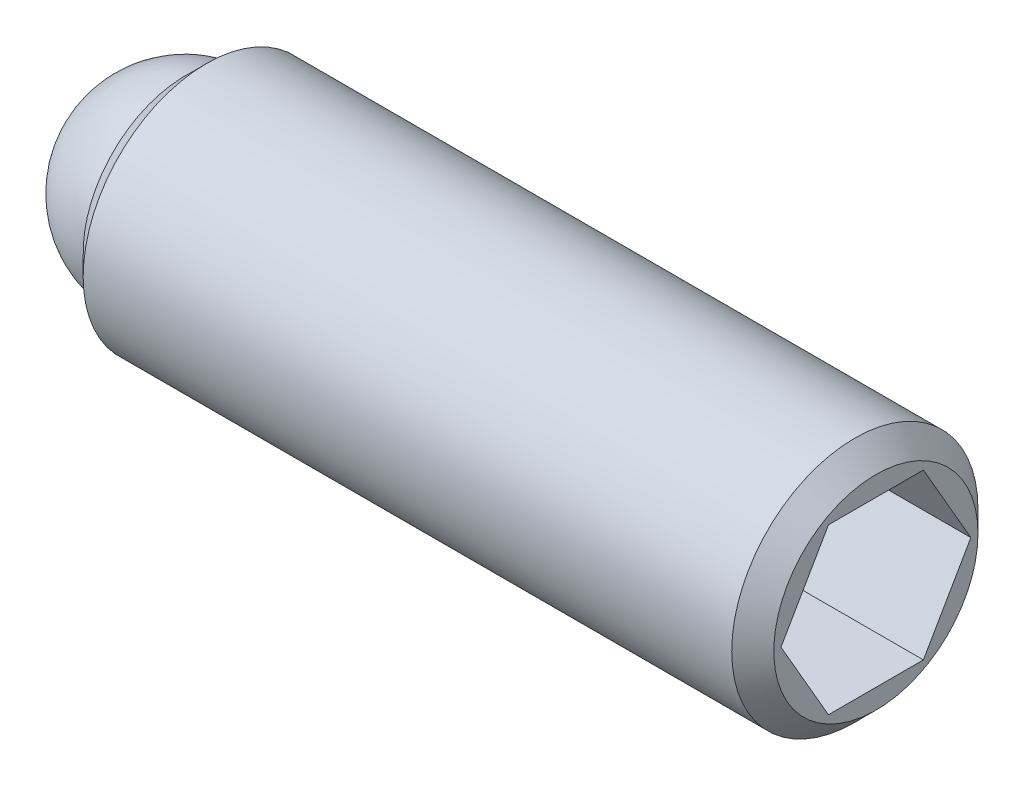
from build123d import *

# Parameters (mm, degrees)
SKETCH2_R           = 1.4859
BOSS_EXTRUDE1_DEPTH = 8.334375
CHAMFER1_SIZE       = 0.254
CHAMFER2_SIZE       = 0.254
CUT_EXTRUDE2_DEPTH  = 2.286
SKETCH3_R           = 1.190625
CUT_EXTRUDE3_DEPTH  = 1.190625


with BuildPart() as part:
    # Sketch2 → Boss-Extrude1 (new body)
    with BuildSketch(Plane(origin=(0, 0, 0), x_dir=(0, 0, -1), z_dir=(1, 0, 0))):
        Circle(SKETCH2_R)
    extrude(amount=BOSS_EXTRUDE1_DEPTH)

    # Chamfer1
    chamfer1_edges = [part.edges().sort_by_distance(p)[0] for p in [
        (0, 0, 1.4859),
    ]]
    chamfer(chamfer1_edges, length=CHAMFER1_SIZE)

    # Chamfer2
    chamfer2_edges = [part.edges().sort_by_distance(p)[0] for p in [
        (8.334375, 0, 1.4859),
    ]]
    chamfer(chamfer2_edges, length=CHAMFER2_SIZE)

    # Sketch4 → Cut-Extrude2 (cut)
    with BuildSketch(Plane(origin=(8.334375, 0, 0), x_dir=(0, 0, -1), z_dir=(1, 0, 0))):
        Polygon((1.14567944, 0), (0.57283972, 0.9921875), (-0.57283972, 0.9921875), (-1.14567944, 0), (-0.57283972, -0.9921875), (0.57283972, -0.9921875), align=None)
    extrude(amount=-CUT_EXTRUDE2_DEPTH, mode=Mode.SUBTRACT)

    # Sketch3 → Cut-Extrude3 (cut)
    with BuildSketch(Plane.ZY):
        Circle(SKETCH3_R)
    extrude(amount=-CUT_EXTRUDE3_DEPTH, mode=Mode.SUBTRACT)


with BuildPart() as body_2:
    # Sketch5 → Revolve1 (revolve)
    with BuildSketch(Plane.ZY):
        with BuildLine():
            Line((0, 0), (0, -1.190625))
            ThreePointArc((0, -1.190625), (-1.190625, 0), (0, 1.190625))
            Line((0, 1.190625), (0, 0))
        make_face()
    revolve(axis=Axis((0, 0, 0), (0, 1, 0)))


solid = Compound([part.part, body_2.part])
